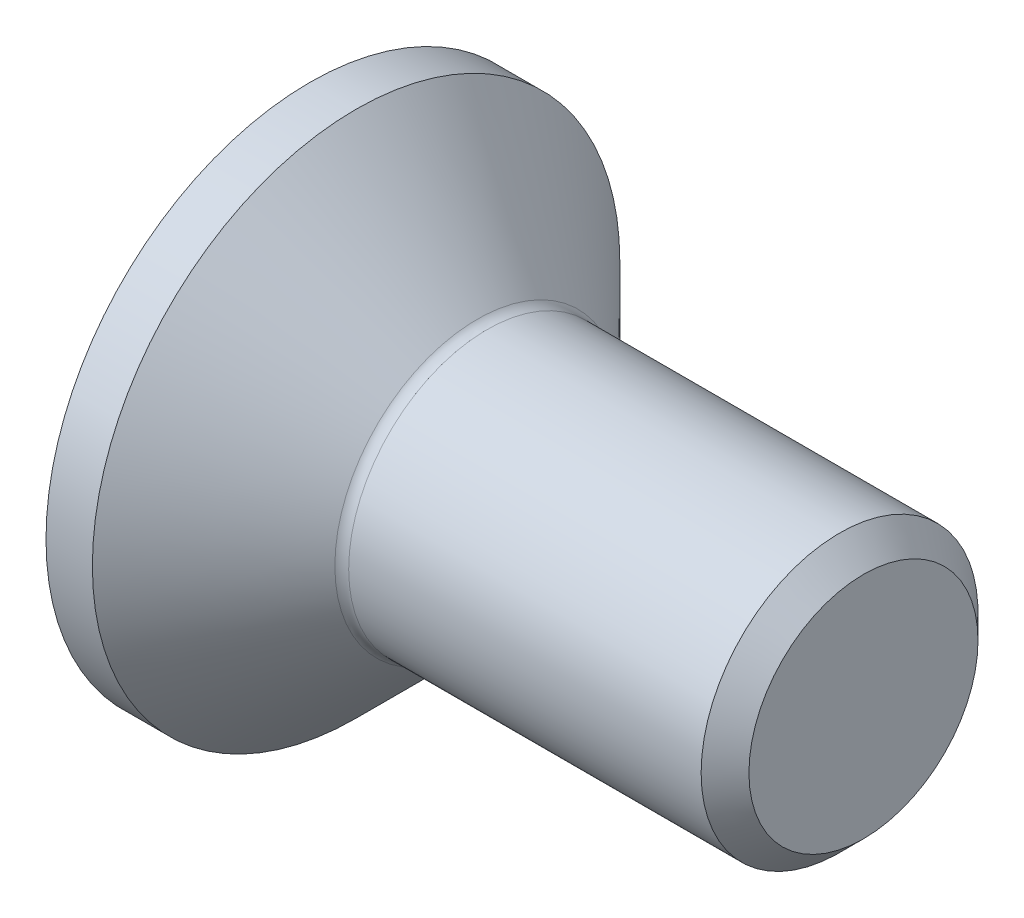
from build123d import *

# Parameters (mm, degrees)
FILLET1_R   = 0.4
HEX_2_DEPTH = 3


with BuildPart() as part:
    # BodySke → BaseBody (revolve)
    with BuildSketch(Plane.XY, mode=Mode.PRIVATE) as basebody_sk:
        Polygon((0, 0), (0, 7.62), (1.34, 7.62), (4.96, 4), (15.3095, 4), (16, 3.3095), (16, 0), align=None)
    revolve(basebody_sk.sketch.rotate(Axis((0, 0, 0), (1, 0, 0)), 90), axis=Axis((0, 0, 0), (1, 0, 0)))

    # Fillet1
    fillet1_edges = [part.edges().sort_by_distance(p)[0] for p in [
        (4.96, 0, -4),
    ]]
    fillet(fillet1_edges, radius=FILLET1_R)

    # Sketch2 → PreBroach (revolve, cut)
    with BuildSketch(Plane.XY, mode=Mode.PRIVATE) as prebroach_sk:
        Polygon((0, 2.5), (3, 2.5), (4.443375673, 0), (0, 0), align=None)
    revolve(prebroach_sk.sketch.rotate(Axis((0, 0, 0), (1, 0, 0)), 90), axis=Axis((0, 0, 0), (1, 0, 0)), mode=Mode.SUBTRACT)

    # Sketch3 → Hex 2 (cut)
    with BuildSketch(Plane.ZY):
        Polygon((-2.5, -1.443375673), (-2.5, 1.443375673), (0, 2.886751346), (2.5, 1.443375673), (2.5, -1.443375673), (0, -2.886751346), align=None)
    extrude(amount=-HEX_2_DEPTH, mode=Mode.SUBTRACT)


solid = part.part
